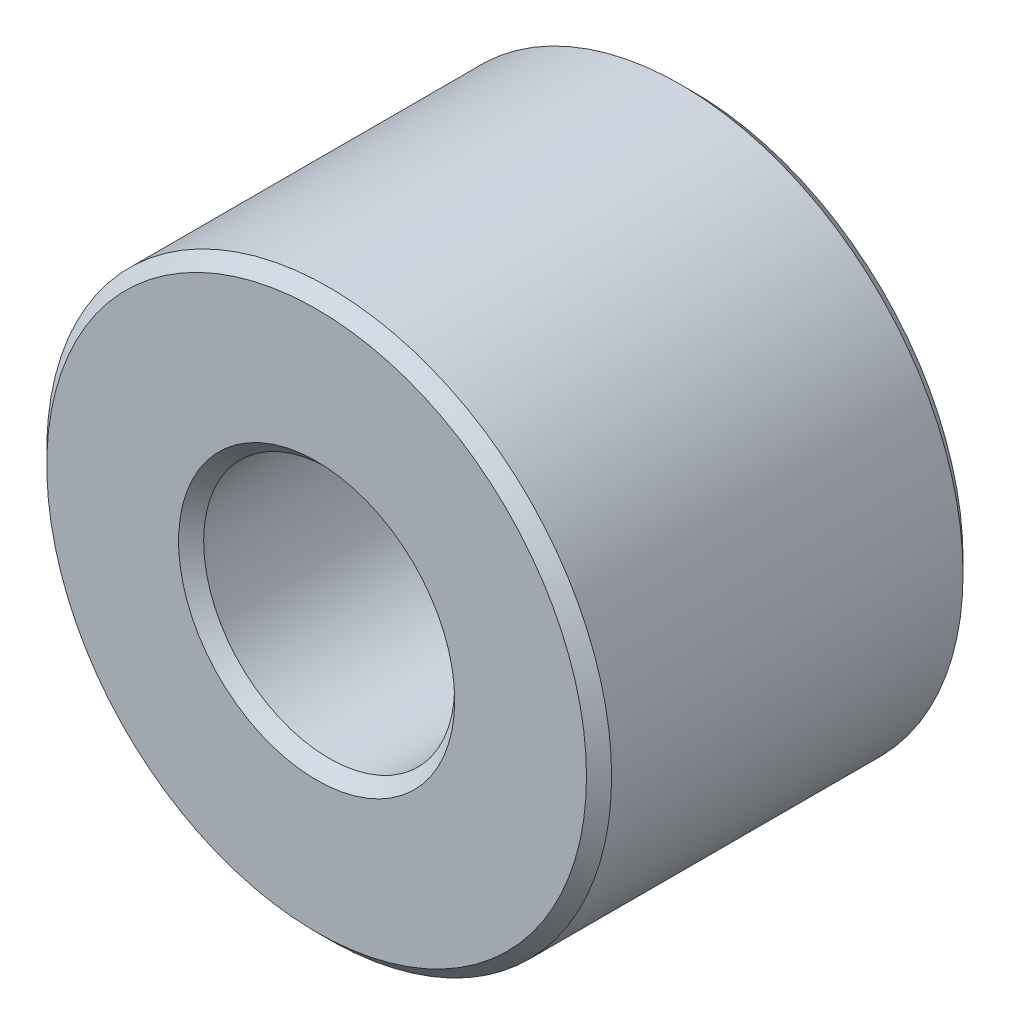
ISO-10303-21;
HEADER;
FILE_DESCRIPTION(('STEP AP214'),'2;1');
FILE_NAME('part.step','',(''),(''),'','','');
FILE_SCHEMA(('AUTOMOTIVE_DESIGN { 1 0 10303 214 1 1 1 1 }'));
ENDSEC;
DATA;
#1=APPLICATION_CONTEXT('core data for automotive mechanical design processes');
#2=APPLICATION_PROTOCOL_DEFINITION('international standard','automotive_design',2000,#1);
#3=PRODUCT_CONTEXT('',#1,'mechanical');
#4=PRODUCT('Part','Part','',(#3));
#5=PRODUCT_RELATED_PRODUCT_CATEGORY('part','',(#4));
#6=PRODUCT_DEFINITION_FORMATION('','',#4);
#7=PRODUCT_DEFINITION_CONTEXT('part definition',#1,'design');
#8=PRODUCT_DEFINITION('design','',#6,#7);
#9=PRODUCT_DEFINITION_SHAPE('','',#8);
#10=(LENGTH_UNIT() NAMED_UNIT(*) SI_UNIT(.MILLI.,.METRE.));
#11=(NAMED_UNIT(*) PLANE_ANGLE_UNIT() SI_UNIT($,.RADIAN.));
#12=(NAMED_UNIT(*) SI_UNIT($,.STERADIAN.) SOLID_ANGLE_UNIT());
#13=UNCERTAINTY_MEASURE_WITH_UNIT(LENGTH_MEASURE(1.E-05),#10,'distance_accuracy_value','');
#14=(GEOMETRIC_REPRESENTATION_CONTEXT(3) GLOBAL_UNCERTAINTY_ASSIGNED_CONTEXT((#13)) GLOBAL_UNIT_ASSIGNED_CONTEXT((#10,
#11,#12)) REPRESENTATION_CONTEXT('',''));
#15=CARTESIAN_POINT('',(0.,0.,0.));
#16=DIRECTION('',(0.,0.,1.));
#17=DIRECTION('',(1.,0.,0.));
#18=AXIS2_PLACEMENT_3D('',#15,#16,#17);
#19=CARTESIAN_POINT('',(0.,0.,6.));
#20=DIRECTION('',(0.,0.,1.));
#21=DIRECTION('',(1.,0.,0.));
#22=AXIS2_PLACEMENT_3D('',#19,#20,#21);
#23=PLANE('',#22);
#24=CARTESIAN_POINT('',(0.,0.,6.));
#25=DIRECTION('',(0.,0.,1.));
#26=DIRECTION('',(1.,0.,0.));
#27=AXIS2_PLACEMENT_3D('',#24,#25,#26);
#28=CIRCLE('',#27,4.4);
#29=CARTESIAN_POINT('',(4.4,0.,6.));
#30=VERTEX_POINT('',#29);
#31=EDGE_CURVE('E10',#30,#30,#28,.F.);
#32=ORIENTED_EDGE('',*,*,#31,.T.);
#33=EDGE_LOOP('',(#32));
#34=FACE_BOUND('',#33,.T.);
#35=CARTESIAN_POINT('',(0.,0.,6.));
#36=DIRECTION('',(0.,0.,1.));
#37=DIRECTION('',(1.,0.,0.));
#38=AXIS2_PLACEMENT_3D('',#35,#36,#37);
#39=CIRCLE('',#38,8.6);
#40=CARTESIAN_POINT('',(8.6,0.,6.));
#41=VERTEX_POINT('',#40);
#42=EDGE_CURVE('E45',#41,#41,#39,.T.);
#43=ORIENTED_EDGE('',*,*,#42,.T.);
#44=EDGE_LOOP('',(#43));
#45=FACE_BOUND('',#44,.T.);
#46=ADVANCED_FACE('F37',(#34,#45),#23,.T.);
#47=CARTESIAN_POINT('',(0.,0.,-6.));
#48=DIRECTION('',(0.,0.,1.));
#49=DIRECTION('',(1.,0.,0.));
#50=AXIS2_PLACEMENT_3D('',#47,#48,#49);
#51=PLANE('',#50);
#52=CARTESIAN_POINT('',(0.,0.,-6.));
#53=DIRECTION('',(0.,0.,1.));
#54=DIRECTION('',(1.,0.,0.));
#55=AXIS2_PLACEMENT_3D('',#52,#53,#54);
#56=CIRCLE('',#55,4.4);
#57=CARTESIAN_POINT('',(4.4,0.,-6.));
#58=VERTEX_POINT('',#57);
#59=EDGE_CURVE('E71',#58,#58,#56,.T.);
#60=ORIENTED_EDGE('',*,*,#59,.T.);
#61=EDGE_LOOP('',(#60));
#62=FACE_BOUND('',#61,.T.);
#63=CARTESIAN_POINT('',(0.,0.,-6.));
#64=DIRECTION('',(0.,0.,1.));
#65=DIRECTION('',(1.,0.,0.));
#66=AXIS2_PLACEMENT_3D('',#63,#64,#65);
#67=CIRCLE('',#66,8.6);
#68=CARTESIAN_POINT('',(8.6,0.,-6.));
#69=VERTEX_POINT('',#68);
#70=EDGE_CURVE('E74',#69,#69,#67,.F.);
#71=ORIENTED_EDGE('',*,*,#70,.T.);
#72=EDGE_LOOP('',(#71));
#73=FACE_BOUND('',#72,.T.);
#74=ADVANCED_FACE('F78',(#62,#73),#51,.F.);
#75=CARTESIAN_POINT('',(0.,0.,6.));
#76=DIRECTION('',(0.,0.,-1.));
#77=DIRECTION('',(-1.,0.,0.));
#78=AXIS2_PLACEMENT_3D('',#75,#76,#77);
#79=CYLINDRICAL_SURFACE('',#78,9.);
#80=CARTESIAN_POINT('',(0.,0.,-5.6));
#81=DIRECTION('',(0.,0.,1.));
#82=DIRECTION('',(1.,0.,0.));
#83=AXIS2_PLACEMENT_3D('',#80,#81,#82);
#84=CIRCLE('',#83,9.);
#85=CARTESIAN_POINT('',(9.,0.,-5.6));
#86=VERTEX_POINT('',#85);
#87=EDGE_CURVE('E51',#86,#86,#84,.T.);
#88=ORIENTED_EDGE('',*,*,#87,.T.);
#89=EDGE_LOOP('',(#88));
#90=FACE_BOUND('',#89,.T.);
#91=CARTESIAN_POINT('',(0.,0.,5.59999999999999));
#92=DIRECTION('',(0.,0.,1.));
#93=DIRECTION('',(1.,0.,0.));
#94=AXIS2_PLACEMENT_3D('',#91,#92,#93);
#95=CIRCLE('',#94,9.);
#96=CARTESIAN_POINT('',(9.,0.,5.59999999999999));
#97=VERTEX_POINT('',#96);
#98=EDGE_CURVE('E57',#97,#97,#95,.F.);
#99=ORIENTED_EDGE('',*,*,#98,.T.);
#100=EDGE_LOOP('',(#99));
#101=FACE_BOUND('',#100,.T.);
#102=ADVANCED_FACE('F88',(#90,#101),#79,.T.);
#103=CARTESIAN_POINT('',(0.,0.,6.));
#104=DIRECTION('',(0.,0.,-1.));
#105=DIRECTION('',(-1.,0.,0.));
#106=AXIS2_PLACEMENT_3D('',#103,#104,#105);
#107=CYLINDRICAL_SURFACE('',#106,4.);
#108=CARTESIAN_POINT('',(0.,0.,-5.6));
#109=DIRECTION('',(0.,0.,1.));
#110=DIRECTION('',(1.,0.,0.));
#111=AXIS2_PLACEMENT_3D('',#108,#109,#110);
#112=CIRCLE('',#111,4.);
#113=CARTESIAN_POINT('',(4.,0.,-5.6));
#114=VERTEX_POINT('',#113);
#115=EDGE_CURVE('E63',#114,#114,#112,.F.);
#116=ORIENTED_EDGE('',*,*,#115,.T.);
#117=EDGE_LOOP('',(#116));
#118=FACE_BOUND('',#117,.T.);
#119=CARTESIAN_POINT('',(0.,0.,5.6));
#120=DIRECTION('',(0.,0.,1.));
#121=DIRECTION('',(1.,0.,0.));
#122=AXIS2_PLACEMENT_3D('',#119,#120,#121);
#123=CIRCLE('',#122,4.);
#124=CARTESIAN_POINT('',(4.,0.,5.6));
#125=VERTEX_POINT('',#124);
#126=EDGE_CURVE('E67',#125,#125,#123,.T.);
#127=ORIENTED_EDGE('',*,*,#126,.T.);
#128=EDGE_LOOP('',(#127));
#129=FACE_BOUND('',#128,.T.);
#130=ADVANCED_FACE('F91',(#118,#129),#107,.F.);
#131=CARTESIAN_POINT('',(0.,0.,-6.));
#132=DIRECTION('',(0.,0.,-1.));
#133=DIRECTION('',(-1.,0.,0.));
#134=AXIS2_PLACEMENT_3D('',#131,#132,#133);
#135=CONICAL_SURFACE('',#134,4.4,0.785398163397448);
#136=ORIENTED_EDGE('',*,*,#115,.F.);
#137=EDGE_LOOP('',(#136));
#138=FACE_BOUND('',#137,.T.);
#139=ORIENTED_EDGE('',*,*,#59,.F.);
#140=EDGE_LOOP('',(#139));
#141=FACE_BOUND('',#140,.T.);
#142=ADVANCED_FACE('F84',(#138,#141),#135,.F.);
#143=CARTESIAN_POINT('',(0.,0.,-5.6));
#144=DIRECTION('',(0.,0.,1.));
#145=DIRECTION('',(1.,0.,0.));
#146=AXIS2_PLACEMENT_3D('',#143,#144,#145);
#147=CONICAL_SURFACE('',#146,9.,0.785398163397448);
#148=ORIENTED_EDGE('',*,*,#70,.F.);
#149=EDGE_LOOP('',(#148));
#150=FACE_BOUND('',#149,.T.);
#151=ORIENTED_EDGE('',*,*,#87,.F.);
#152=EDGE_LOOP('',(#151));
#153=FACE_BOUND('',#152,.T.);
#154=ADVANCED_FACE('F80',(#150,#153),#147,.T.);
#155=CARTESIAN_POINT('',(0.,0.,5.6));
#156=DIRECTION('',(0.,0.,1.));
#157=DIRECTION('',(1.,0.,0.));
#158=AXIS2_PLACEMENT_3D('',#155,#156,#157);
#159=CONICAL_SURFACE('',#158,4.,0.785398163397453);
#160=ORIENTED_EDGE('',*,*,#31,.F.);
#161=EDGE_LOOP('',(#160));
#162=FACE_BOUND('',#161,.T.);
#163=ORIENTED_EDGE('',*,*,#126,.F.);
#164=EDGE_LOOP('',(#163));
#165=FACE_BOUND('',#164,.T.);
#166=ADVANCED_FACE('F83',(#162,#165),#159,.F.);
#167=CARTESIAN_POINT('',(0.,0.,6.));
#168=DIRECTION('',(0.,0.,-1.));
#169=DIRECTION('',(-1.,0.,0.));
#170=AXIS2_PLACEMENT_3D('',#167,#168,#169);
#171=CONICAL_SURFACE('',#170,8.6,0.785398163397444);
#172=ORIENTED_EDGE('',*,*,#98,.F.);
#173=EDGE_LOOP('',(#172));
#174=FACE_BOUND('',#173,.T.);
#175=ORIENTED_EDGE('',*,*,#42,.F.);
#176=EDGE_LOOP('',(#175));
#177=FACE_BOUND('',#176,.T.);
#178=ADVANCED_FACE('F39',(#174,#177),#171,.T.);
#179=CLOSED_SHELL('',(#46,#74,#102,#130,#142,#154,#166,#178));
#180=MANIFOLD_SOLID_BREP('B2',#179);
#181=ADVANCED_BREP_SHAPE_REPRESENTATION('',(#18,#180),#14);
#182=SHAPE_DEFINITION_REPRESENTATION(#9,#181);
ENDSEC;
END-ISO-10303-21;
